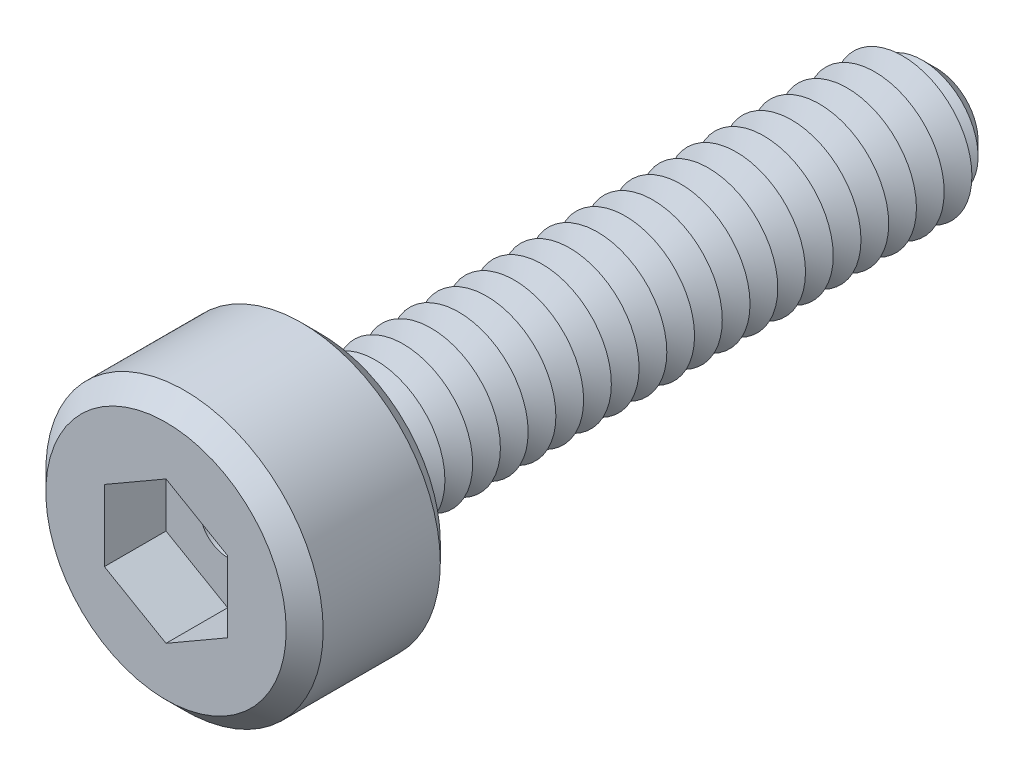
ISO-10303-21;
HEADER;
FILE_DESCRIPTION(('STEP AP214'),'2;1');
FILE_NAME('part.step','',(''),(''),'','','');
FILE_SCHEMA(('AUTOMOTIVE_DESIGN { 1 0 10303 214 1 1 1 1 }'));
ENDSEC;
DATA;
#1=APPLICATION_CONTEXT('core data for automotive mechanical design processes');
#2=APPLICATION_PROTOCOL_DEFINITION('international standard','automotive_design',2000,#1);
#3=PRODUCT_CONTEXT('',#1,'mechanical');
#4=PRODUCT('Part','Part','',(#3));
#5=PRODUCT_RELATED_PRODUCT_CATEGORY('part','',(#4));
#6=PRODUCT_DEFINITION_FORMATION('','',#4);
#7=PRODUCT_DEFINITION_CONTEXT('part definition',#1,'design');
#8=PRODUCT_DEFINITION('design','',#6,#7);
#9=PRODUCT_DEFINITION_SHAPE('','',#8);
#10=(LENGTH_UNIT() NAMED_UNIT(*) SI_UNIT(.MILLI.,.METRE.));
#11=(NAMED_UNIT(*) PLANE_ANGLE_UNIT() SI_UNIT($,.RADIAN.));
#12=(NAMED_UNIT(*) SI_UNIT($,.STERADIAN.) SOLID_ANGLE_UNIT());
#13=UNCERTAINTY_MEASURE_WITH_UNIT(LENGTH_MEASURE(1.E-05),#10,'distance_accuracy_value','');
#14=(GEOMETRIC_REPRESENTATION_CONTEXT(3) GLOBAL_UNCERTAINTY_ASSIGNED_CONTEXT((#13)) GLOBAL_UNIT_ASSIGNED_CONTEXT((#10,
#11,#12)) REPRESENTATION_CONTEXT('',''));
#15=CARTESIAN_POINT('',(0.,0.,0.));
#16=DIRECTION('',(0.,0.,1.));
#17=DIRECTION('',(1.,0.,0.));
#18=AXIS2_PLACEMENT_3D('',#15,#16,#17);
#19=CARTESIAN_POINT('',(0.,0.,2.5));
#20=DIRECTION('',(0.,0.,-1.));
#21=DIRECTION('',(-1.,0.,0.));
#22=AXIS2_PLACEMENT_3D('',#19,#20,#21);
#23=CYLINDRICAL_SURFACE('',#22,2.25);
#24=CARTESIAN_POINT('',(0.,0.,0.299999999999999));
#25=DIRECTION('',(0.,0.,1.));
#26=DIRECTION('',(1.,0.,0.));
#27=AXIS2_PLACEMENT_3D('',#24,#25,#26);
#28=CIRCLE('',#27,2.25);
#29=CARTESIAN_POINT('',(2.25,0.,0.299999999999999));
#30=VERTEX_POINT('',#29);
#31=EDGE_CURVE('E353',#30,#30,#28,.T.);
#32=ORIENTED_EDGE('',*,*,#31,.T.);
#33=EDGE_LOOP('',(#32));
#34=FACE_BOUND('',#33,.T.);
#35=CARTESIAN_POINT('',(0.,0.,2.2));
#36=DIRECTION('',(0.,0.,1.));
#37=DIRECTION('',(1.,0.,0.));
#38=AXIS2_PLACEMENT_3D('',#35,#36,#37);
#39=CIRCLE('',#38,2.25);
#40=CARTESIAN_POINT('',(2.25,0.,2.2));
#41=VERTEX_POINT('',#40);
#42=EDGE_CURVE('E346',#41,#41,#39,.F.);
#43=ORIENTED_EDGE('',*,*,#42,.T.);
#44=EDGE_LOOP('',(#43));
#45=FACE_BOUND('',#44,.T.);
#46=ADVANCED_FACE('F39',(#34,#45),#23,.T.);
#47=CARTESIAN_POINT('',(0.,0.,2.5));
#48=DIRECTION('',(0.,0.,1.));
#49=DIRECTION('',(1.,0.,0.));
#50=AXIS2_PLACEMENT_3D('',#47,#48,#49);
#51=PLANE('',#50);
#52=CARTESIAN_POINT('',(0.,0.,2.5));
#53=DIRECTION('',(0.,0.,1.));
#54=DIRECTION('',(1.,0.,0.));
#55=AXIS2_PLACEMENT_3D('',#52,#53,#54);
#56=CIRCLE('',#55,1.95);
#57=CARTESIAN_POINT('',(1.95,0.,2.5));
#58=VERTEX_POINT('',#57);
#59=EDGE_CURVE('E11',#58,#58,#56,.T.);
#60=ORIENTED_EDGE('',*,*,#59,.T.);
#61=EDGE_LOOP('',(#60));
#62=FACE_BOUND('',#61,.T.);
#63=DIRECTION('',(-0.866025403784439,0.5,0.));
#64=VECTOR('',#63,1.);
#65=CARTESIAN_POINT('',(0.999999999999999,0.577350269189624,2.5));
#66=LINE('',#65,#64);
#67=CARTESIAN_POINT('',(0.999999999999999,0.577350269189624,2.5));
#68=VERTEX_POINT('',#67);
#69=CARTESIAN_POINT('',(0.,1.15470053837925,2.5));
#70=VERTEX_POINT('',#69);
#71=EDGE_CURVE('E55',#68,#70,#66,.T.);
#72=ORIENTED_EDGE('',*,*,#71,.F.);
#73=DIRECTION('',(0.,1.,0.));
#74=VECTOR('',#73,1.);
#75=CARTESIAN_POINT('',(1.,-0.577350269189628,2.5));
#76=LINE('',#75,#74);
#77=CARTESIAN_POINT('',(1.,-0.577350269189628,2.5));
#78=VERTEX_POINT('',#77);
#79=EDGE_CURVE('E150',#78,#68,#76,.T.);
#80=ORIENTED_EDGE('',*,*,#79,.F.);
#81=DIRECTION('',(0.866025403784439,0.5,0.));
#82=VECTOR('',#81,1.);
#83=CARTESIAN_POINT('',(0.,-1.15470053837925,2.5));
#84=LINE('',#83,#82);
#85=CARTESIAN_POINT('',(0.,-1.15470053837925,2.5));
#86=VERTEX_POINT('',#85);
#87=EDGE_CURVE('E147',#86,#78,#84,.T.);
#88=ORIENTED_EDGE('',*,*,#87,.F.);
#89=DIRECTION('',(0.866025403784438,-0.5,0.));
#90=VECTOR('',#89,1.);
#91=CARTESIAN_POINT('',(-1.,-0.577350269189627,2.5));
#92=LINE('',#91,#90);
#93=CARTESIAN_POINT('',(-1.,-0.577350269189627,2.5));
#94=VERTEX_POINT('',#93);
#95=EDGE_CURVE('E103',#94,#86,#92,.T.);
#96=ORIENTED_EDGE('',*,*,#95,.F.);
#97=DIRECTION('',(0.,-1.,0.));
#98=VECTOR('',#97,1.);
#99=CARTESIAN_POINT('',(-1.,0.577350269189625,2.5));
#100=LINE('',#99,#98);
#101=CARTESIAN_POINT('',(-1.,0.577350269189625,2.5));
#102=VERTEX_POINT('',#101);
#103=EDGE_CURVE('E142',#102,#94,#100,.T.);
#104=ORIENTED_EDGE('',*,*,#103,.F.);
#105=DIRECTION('',(-0.866025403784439,-0.5,0.));
#106=VECTOR('',#105,1.);
#107=CARTESIAN_POINT('',(0.,1.15470053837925,2.5));
#108=LINE('',#107,#106);
#109=EDGE_CURVE('E137',#70,#102,#108,.T.);
#110=ORIENTED_EDGE('',*,*,#109,.F.);
#111=EDGE_LOOP('',(#72,#80,#88,#96,#104,#110));
#112=FACE_BOUND('',#111,.T.);
#113=ADVANCED_FACE('F371',(#62,#112),#51,.T.);
#114=CARTESIAN_POINT('',(0.,0.,0.));
#115=DIRECTION('',(0.,0.,1.));
#116=DIRECTION('',(1.,0.,0.));
#117=AXIS2_PLACEMENT_3D('',#114,#115,#116);
#118=PLANE('',#117);
#119=CARTESIAN_POINT('',(0.,0.,0.));
#120=DIRECTION('',(0.,0.,1.));
#121=DIRECTION('',(1.,0.,0.));
#122=AXIS2_PLACEMENT_3D('',#119,#120,#121);
#123=CIRCLE('',#122,1.95);
#124=CARTESIAN_POINT('',(1.95,0.,0.));
#125=VERTEX_POINT('',#124);
#126=EDGE_CURVE('E48',#125,#125,#123,.F.);
#127=ORIENTED_EDGE('',*,*,#126,.T.);
#128=EDGE_LOOP('',(#127));
#129=FACE_BOUND('',#128,.T.);
#130=CARTESIAN_POINT('',(0.,0.,0.));
#131=DIRECTION('',(0.,0.,1.));
#132=DIRECTION('',(1.,0.,0.));
#133=AXIS2_PLACEMENT_3D('',#130,#131,#132);
#134=CIRCLE('',#133,1.125);
#135=CARTESIAN_POINT('',(1.125,0.,0.));
#136=VERTEX_POINT('',#135);
#137=EDGE_CURVE('E338',#136,#136,#134,.T.);
#138=ORIENTED_EDGE('',*,*,#137,.T.);
#139=EDGE_LOOP('',(#138));
#140=FACE_BOUND('',#139,.T.);
#141=ADVANCED_FACE('F360',(#129,#140),#118,.F.);
#142=CARTESIAN_POINT('',(0.,0.,0.));
#143=DIRECTION('',(0.,0.,1.));
#144=DIRECTION('',(1.,0.,0.));
#145=AXIS2_PLACEMENT_3D('',#142,#143,#144);
#146=CONICAL_SURFACE('',#145,1.125,1.0471975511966);
#147=CARTESIAN_POINT('',(0.,0.,-0.225));
#148=DIRECTION('',(0.,0.,1.));
#149=DIRECTION('',(1.,0.,0.));
#150=AXIS2_PLACEMENT_3D('',#147,#148,#149);
#151=CIRCLE('',#150,0.735288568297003);
#152=CARTESIAN_POINT('',(0.735288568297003,0.,-0.225));
#153=VERTEX_POINT('',#152);
#154=EDGE_CURVE('E334',#153,#153,#151,.T.);
#155=ORIENTED_EDGE('',*,*,#154,.T.);
#156=EDGE_LOOP('',(#155));
#157=FACE_BOUND('',#156,.T.);
#158=ORIENTED_EDGE('',*,*,#137,.F.);
#159=EDGE_LOOP('',(#158));
#160=FACE_BOUND('',#159,.T.);
#161=ADVANCED_FACE('F596',(#157,#160),#146,.T.);
#162=CARTESIAN_POINT('',(0.,0.,-0.225));
#163=DIRECTION('',(0.,0.,-1.));
#164=DIRECTION('',(-1.,0.,0.));
#165=AXIS2_PLACEMENT_3D('',#162,#163,#164);
#166=CONICAL_SURFACE('',#165,0.735288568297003,1.0471975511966);
#167=CARTESIAN_POINT('',(0.,0.,-0.45));
#168=DIRECTION('',(0.,0.,1.));
#169=DIRECTION('',(1.,0.,0.));
#170=AXIS2_PLACEMENT_3D('',#167,#168,#169);
#171=CIRCLE('',#170,1.125);
#172=CARTESIAN_POINT('',(1.125,0.,-0.45));
#173=VERTEX_POINT('',#172);
#174=EDGE_CURVE('E330',#173,#173,#171,.T.);
#175=ORIENTED_EDGE('',*,*,#174,.T.);
#176=EDGE_LOOP('',(#175));
#177=FACE_BOUND('',#176,.T.);
#178=ORIENTED_EDGE('',*,*,#154,.F.);
#179=EDGE_LOOP('',(#178));
#180=FACE_BOUND('',#179,.T.);
#181=ADVANCED_FACE('F592',(#177,#180),#166,.T.);
#182=CARTESIAN_POINT('',(0.,0.,-0.45));
#183=DIRECTION('',(0.,0.,1.));
#184=DIRECTION('',(1.,0.,0.));
#185=AXIS2_PLACEMENT_3D('',#182,#183,#184);
#186=CONICAL_SURFACE('',#185,1.125,1.0471975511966);
#187=CARTESIAN_POINT('',(0.,0.,-0.675));
#188=DIRECTION('',(0.,0.,1.));
#189=DIRECTION('',(1.,0.,0.));
#190=AXIS2_PLACEMENT_3D('',#187,#188,#189);
#191=CIRCLE('',#190,0.735288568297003);
#192=CARTESIAN_POINT('',(0.735288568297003,0.,-0.675));
#193=VERTEX_POINT('',#192);
#194=EDGE_CURVE('E326',#193,#193,#191,.T.);
#195=ORIENTED_EDGE('',*,*,#194,.T.);
#196=EDGE_LOOP('',(#195));
#197=FACE_BOUND('',#196,.T.);
#198=ORIENTED_EDGE('',*,*,#174,.F.);
#199=EDGE_LOOP('',(#198));
#200=FACE_BOUND('',#199,.T.);
#201=ADVANCED_FACE('F588',(#197,#200),#186,.T.);
#202=CARTESIAN_POINT('',(0.,0.,-0.675));
#203=DIRECTION('',(0.,0.,-1.));
#204=DIRECTION('',(-1.,0.,0.));
#205=AXIS2_PLACEMENT_3D('',#202,#203,#204);
#206=CONICAL_SURFACE('',#205,0.735288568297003,1.0471975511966);
#207=CARTESIAN_POINT('',(0.,0.,-0.9));
#208=DIRECTION('',(0.,0.,1.));
#209=DIRECTION('',(1.,0.,0.));
#210=AXIS2_PLACEMENT_3D('',#207,#208,#209);
#211=CIRCLE('',#210,1.125);
#212=CARTESIAN_POINT('',(1.125,0.,-0.9));
#213=VERTEX_POINT('',#212);
#214=EDGE_CURVE('E322',#213,#213,#211,.T.);
#215=ORIENTED_EDGE('',*,*,#214,.T.);
#216=EDGE_LOOP('',(#215));
#217=FACE_BOUND('',#216,.T.);
#218=ORIENTED_EDGE('',*,*,#194,.F.);
#219=EDGE_LOOP('',(#218));
#220=FACE_BOUND('',#219,.T.);
#221=ADVANCED_FACE('F584',(#217,#220),#206,.T.);
#222=CARTESIAN_POINT('',(0.,0.,-0.9));
#223=DIRECTION('',(0.,0.,1.));
#224=DIRECTION('',(1.,0.,0.));
#225=AXIS2_PLACEMENT_3D('',#222,#223,#224);
#226=CONICAL_SURFACE('',#225,1.125,1.0471975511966);
#227=CARTESIAN_POINT('',(0.,0.,-1.125));
#228=DIRECTION('',(0.,0.,1.));
#229=DIRECTION('',(1.,0.,0.));
#230=AXIS2_PLACEMENT_3D('',#227,#228,#229);
#231=CIRCLE('',#230,0.735288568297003);
#232=CARTESIAN_POINT('',(0.735288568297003,0.,-1.125));
#233=VERTEX_POINT('',#232);
#234=EDGE_CURVE('E318',#233,#233,#231,.T.);
#235=ORIENTED_EDGE('',*,*,#234,.T.);
#236=EDGE_LOOP('',(#235));
#237=FACE_BOUND('',#236,.T.);
#238=ORIENTED_EDGE('',*,*,#214,.F.);
#239=EDGE_LOOP('',(#238));
#240=FACE_BOUND('',#239,.T.);
#241=ADVANCED_FACE('F580',(#237,#240),#226,.T.);
#242=CARTESIAN_POINT('',(0.,0.,-1.125));
#243=DIRECTION('',(0.,0.,-1.));
#244=DIRECTION('',(-1.,0.,0.));
#245=AXIS2_PLACEMENT_3D('',#242,#243,#244);
#246=CONICAL_SURFACE('',#245,0.735288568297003,1.0471975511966);
#247=CARTESIAN_POINT('',(0.,0.,-1.35));
#248=DIRECTION('',(0.,0.,1.));
#249=DIRECTION('',(1.,0.,0.));
#250=AXIS2_PLACEMENT_3D('',#247,#248,#249);
#251=CIRCLE('',#250,1.125);
#252=CARTESIAN_POINT('',(1.125,0.,-1.35));
#253=VERTEX_POINT('',#252);
#254=EDGE_CURVE('E314',#253,#253,#251,.T.);
#255=ORIENTED_EDGE('',*,*,#254,.T.);
#256=EDGE_LOOP('',(#255));
#257=FACE_BOUND('',#256,.T.);
#258=ORIENTED_EDGE('',*,*,#234,.F.);
#259=EDGE_LOOP('',(#258));
#260=FACE_BOUND('',#259,.T.);
#261=ADVANCED_FACE('F576',(#257,#260),#246,.T.);
#262=CARTESIAN_POINT('',(0.,0.,-1.35));
#263=DIRECTION('',(0.,0.,1.));
#264=DIRECTION('',(1.,0.,0.));
#265=AXIS2_PLACEMENT_3D('',#262,#263,#264);
#266=CONICAL_SURFACE('',#265,1.125,1.0471975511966);
#267=CARTESIAN_POINT('',(0.,0.,-1.575));
#268=DIRECTION('',(0.,0.,1.));
#269=DIRECTION('',(1.,0.,0.));
#270=AXIS2_PLACEMENT_3D('',#267,#268,#269);
#271=CIRCLE('',#270,0.735288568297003);
#272=CARTESIAN_POINT('',(0.735288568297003,0.,-1.575));
#273=VERTEX_POINT('',#272);
#274=EDGE_CURVE('E310',#273,#273,#271,.T.);
#275=ORIENTED_EDGE('',*,*,#274,.T.);
#276=EDGE_LOOP('',(#275));
#277=FACE_BOUND('',#276,.T.);
#278=ORIENTED_EDGE('',*,*,#254,.F.);
#279=EDGE_LOOP('',(#278));
#280=FACE_BOUND('',#279,.T.);
#281=ADVANCED_FACE('F572',(#277,#280),#266,.T.);
#282=CARTESIAN_POINT('',(0.,0.,-1.575));
#283=DIRECTION('',(0.,0.,-1.));
#284=DIRECTION('',(-1.,0.,0.));
#285=AXIS2_PLACEMENT_3D('',#282,#283,#284);
#286=CONICAL_SURFACE('',#285,0.735288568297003,1.0471975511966);
#287=CARTESIAN_POINT('',(0.,0.,-1.8));
#288=DIRECTION('',(0.,0.,1.));
#289=DIRECTION('',(1.,0.,0.));
#290=AXIS2_PLACEMENT_3D('',#287,#288,#289);
#291=CIRCLE('',#290,1.125);
#292=CARTESIAN_POINT('',(1.125,0.,-1.8));
#293=VERTEX_POINT('',#292);
#294=EDGE_CURVE('E306',#293,#293,#291,.T.);
#295=ORIENTED_EDGE('',*,*,#294,.T.);
#296=EDGE_LOOP('',(#295));
#297=FACE_BOUND('',#296,.T.);
#298=ORIENTED_EDGE('',*,*,#274,.F.);
#299=EDGE_LOOP('',(#298));
#300=FACE_BOUND('',#299,.T.);
#301=ADVANCED_FACE('F568',(#297,#300),#286,.T.);
#302=CARTESIAN_POINT('',(0.,0.,-1.8));
#303=DIRECTION('',(0.,0.,1.));
#304=DIRECTION('',(1.,0.,0.));
#305=AXIS2_PLACEMENT_3D('',#302,#303,#304);
#306=CONICAL_SURFACE('',#305,1.125,1.0471975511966);
#307=CARTESIAN_POINT('',(0.,0.,-2.025));
#308=DIRECTION('',(0.,0.,1.));
#309=DIRECTION('',(1.,0.,0.));
#310=AXIS2_PLACEMENT_3D('',#307,#308,#309);
#311=CIRCLE('',#310,0.735288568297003);
#312=CARTESIAN_POINT('',(0.735288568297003,0.,-2.025));
#313=VERTEX_POINT('',#312);
#314=EDGE_CURVE('E302',#313,#313,#311,.T.);
#315=ORIENTED_EDGE('',*,*,#314,.T.);
#316=EDGE_LOOP('',(#315));
#317=FACE_BOUND('',#316,.T.);
#318=ORIENTED_EDGE('',*,*,#294,.F.);
#319=EDGE_LOOP('',(#318));
#320=FACE_BOUND('',#319,.T.);
#321=ADVANCED_FACE('F564',(#317,#320),#306,.T.);
#322=CARTESIAN_POINT('',(0.,0.,-2.025));
#323=DIRECTION('',(0.,0.,-1.));
#324=DIRECTION('',(-1.,0.,0.));
#325=AXIS2_PLACEMENT_3D('',#322,#323,#324);
#326=CONICAL_SURFACE('',#325,0.735288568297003,1.0471975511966);
#327=CARTESIAN_POINT('',(0.,0.,-2.25));
#328=DIRECTION('',(0.,0.,1.));
#329=DIRECTION('',(1.,0.,0.));
#330=AXIS2_PLACEMENT_3D('',#327,#328,#329);
#331=CIRCLE('',#330,1.125);
#332=CARTESIAN_POINT('',(1.125,0.,-2.25));
#333=VERTEX_POINT('',#332);
#334=EDGE_CURVE('E298',#333,#333,#331,.T.);
#335=ORIENTED_EDGE('',*,*,#334,.T.);
#336=EDGE_LOOP('',(#335));
#337=FACE_BOUND('',#336,.T.);
#338=ORIENTED_EDGE('',*,*,#314,.F.);
#339=EDGE_LOOP('',(#338));
#340=FACE_BOUND('',#339,.T.);
#341=ADVANCED_FACE('F560',(#337,#340),#326,.T.);
#342=CARTESIAN_POINT('',(0.,0.,-2.25));
#343=DIRECTION('',(0.,0.,1.));
#344=DIRECTION('',(1.,0.,0.));
#345=AXIS2_PLACEMENT_3D('',#342,#343,#344);
#346=CONICAL_SURFACE('',#345,1.125,1.0471975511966);
#347=CARTESIAN_POINT('',(0.,0.,-2.475));
#348=DIRECTION('',(0.,0.,1.));
#349=DIRECTION('',(1.,0.,0.));
#350=AXIS2_PLACEMENT_3D('',#347,#348,#349);
#351=CIRCLE('',#350,0.735288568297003);
#352=CARTESIAN_POINT('',(0.735288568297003,0.,-2.475));
#353=VERTEX_POINT('',#352);
#354=EDGE_CURVE('E294',#353,#353,#351,.T.);
#355=ORIENTED_EDGE('',*,*,#354,.T.);
#356=EDGE_LOOP('',(#355));
#357=FACE_BOUND('',#356,.T.);
#358=ORIENTED_EDGE('',*,*,#334,.F.);
#359=EDGE_LOOP('',(#358));
#360=FACE_BOUND('',#359,.T.);
#361=ADVANCED_FACE('F556',(#357,#360),#346,.T.);
#362=CARTESIAN_POINT('',(0.,0.,-2.475));
#363=DIRECTION('',(0.,0.,-1.));
#364=DIRECTION('',(-1.,0.,0.));
#365=AXIS2_PLACEMENT_3D('',#362,#363,#364);
#366=CONICAL_SURFACE('',#365,0.735288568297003,1.0471975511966);
#367=CARTESIAN_POINT('',(0.,0.,-2.7));
#368=DIRECTION('',(0.,0.,1.));
#369=DIRECTION('',(1.,0.,0.));
#370=AXIS2_PLACEMENT_3D('',#367,#368,#369);
#371=CIRCLE('',#370,1.125);
#372=CARTESIAN_POINT('',(1.125,0.,-2.7));
#373=VERTEX_POINT('',#372);
#374=EDGE_CURVE('E290',#373,#373,#371,.T.);
#375=ORIENTED_EDGE('',*,*,#374,.T.);
#376=EDGE_LOOP('',(#375));
#377=FACE_BOUND('',#376,.T.);
#378=ORIENTED_EDGE('',*,*,#354,.F.);
#379=EDGE_LOOP('',(#378));
#380=FACE_BOUND('',#379,.T.);
#381=ADVANCED_FACE('F552',(#377,#380),#366,.T.);
#382=CARTESIAN_POINT('',(0.,0.,-2.7));
#383=DIRECTION('',(0.,0.,1.));
#384=DIRECTION('',(1.,0.,0.));
#385=AXIS2_PLACEMENT_3D('',#382,#383,#384);
#386=CONICAL_SURFACE('',#385,1.125,1.0471975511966);
#387=CARTESIAN_POINT('',(0.,0.,-2.925));
#388=DIRECTION('',(0.,0.,1.));
#389=DIRECTION('',(1.,0.,0.));
#390=AXIS2_PLACEMENT_3D('',#387,#388,#389);
#391=CIRCLE('',#390,0.735288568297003);
#392=CARTESIAN_POINT('',(0.735288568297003,0.,-2.925));
#393=VERTEX_POINT('',#392);
#394=EDGE_CURVE('E286',#393,#393,#391,.T.);
#395=ORIENTED_EDGE('',*,*,#394,.T.);
#396=EDGE_LOOP('',(#395));
#397=FACE_BOUND('',#396,.T.);
#398=ORIENTED_EDGE('',*,*,#374,.F.);
#399=EDGE_LOOP('',(#398));
#400=FACE_BOUND('',#399,.T.);
#401=ADVANCED_FACE('F548',(#397,#400),#386,.T.);
#402=CARTESIAN_POINT('',(0.,0.,-2.925));
#403=DIRECTION('',(0.,0.,-1.));
#404=DIRECTION('',(-1.,0.,0.));
#405=AXIS2_PLACEMENT_3D('',#402,#403,#404);
#406=CONICAL_SURFACE('',#405,0.735288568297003,1.0471975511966);
#407=CARTESIAN_POINT('',(0.,0.,-3.15));
#408=DIRECTION('',(0.,0.,1.));
#409=DIRECTION('',(1.,0.,0.));
#410=AXIS2_PLACEMENT_3D('',#407,#408,#409);
#411=CIRCLE('',#410,1.125);
#412=CARTESIAN_POINT('',(1.125,0.,-3.15));
#413=VERTEX_POINT('',#412);
#414=EDGE_CURVE('E282',#413,#413,#411,.T.);
#415=ORIENTED_EDGE('',*,*,#414,.T.);
#416=EDGE_LOOP('',(#415));
#417=FACE_BOUND('',#416,.T.);
#418=ORIENTED_EDGE('',*,*,#394,.F.);
#419=EDGE_LOOP('',(#418));
#420=FACE_BOUND('',#419,.T.);
#421=ADVANCED_FACE('F544',(#417,#420),#406,.T.);
#422=CARTESIAN_POINT('',(0.,0.,-3.15));
#423=DIRECTION('',(0.,0.,1.));
#424=DIRECTION('',(1.,0.,0.));
#425=AXIS2_PLACEMENT_3D('',#422,#423,#424);
#426=CONICAL_SURFACE('',#425,1.125,1.0471975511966);
#427=CARTESIAN_POINT('',(0.,0.,-3.375));
#428=DIRECTION('',(0.,0.,1.));
#429=DIRECTION('',(1.,0.,0.));
#430=AXIS2_PLACEMENT_3D('',#427,#428,#429);
#431=CIRCLE('',#430,0.735288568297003);
#432=CARTESIAN_POINT('',(0.735288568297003,0.,-3.375));
#433=VERTEX_POINT('',#432);
#434=EDGE_CURVE('E278',#433,#433,#431,.T.);
#435=ORIENTED_EDGE('',*,*,#434,.T.);
#436=EDGE_LOOP('',(#435));
#437=FACE_BOUND('',#436,.T.);
#438=ORIENTED_EDGE('',*,*,#414,.F.);
#439=EDGE_LOOP('',(#438));
#440=FACE_BOUND('',#439,.T.);
#441=ADVANCED_FACE('F540',(#437,#440),#426,.T.);
#442=CARTESIAN_POINT('',(0.,0.,-3.375));
#443=DIRECTION('',(0.,0.,-1.));
#444=DIRECTION('',(-1.,0.,0.));
#445=AXIS2_PLACEMENT_3D('',#442,#443,#444);
#446=CONICAL_SURFACE('',#445,0.735288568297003,1.0471975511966);
#447=CARTESIAN_POINT('',(0.,0.,-3.6));
#448=DIRECTION('',(0.,0.,1.));
#449=DIRECTION('',(1.,0.,0.));
#450=AXIS2_PLACEMENT_3D('',#447,#448,#449);
#451=CIRCLE('',#450,1.125);
#452=CARTESIAN_POINT('',(1.125,0.,-3.6));
#453=VERTEX_POINT('',#452);
#454=EDGE_CURVE('E274',#453,#453,#451,.T.);
#455=ORIENTED_EDGE('',*,*,#454,.T.);
#456=EDGE_LOOP('',(#455));
#457=FACE_BOUND('',#456,.T.);
#458=ORIENTED_EDGE('',*,*,#434,.F.);
#459=EDGE_LOOP('',(#458));
#460=FACE_BOUND('',#459,.T.);
#461=ADVANCED_FACE('F536',(#457,#460),#446,.T.);
#462=CARTESIAN_POINT('',(0.,0.,-3.6));
#463=DIRECTION('',(0.,0.,1.));
#464=DIRECTION('',(1.,0.,0.));
#465=AXIS2_PLACEMENT_3D('',#462,#463,#464);
#466=CONICAL_SURFACE('',#465,1.125,1.0471975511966);
#467=CARTESIAN_POINT('',(0.,0.,-3.825));
#468=DIRECTION('',(0.,0.,1.));
#469=DIRECTION('',(1.,0.,0.));
#470=AXIS2_PLACEMENT_3D('',#467,#468,#469);
#471=CIRCLE('',#470,0.735288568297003);
#472=CARTESIAN_POINT('',(0.735288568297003,0.,-3.825));
#473=VERTEX_POINT('',#472);
#474=EDGE_CURVE('E270',#473,#473,#471,.T.);
#475=ORIENTED_EDGE('',*,*,#474,.T.);
#476=EDGE_LOOP('',(#475));
#477=FACE_BOUND('',#476,.T.);
#478=ORIENTED_EDGE('',*,*,#454,.F.);
#479=EDGE_LOOP('',(#478));
#480=FACE_BOUND('',#479,.T.);
#481=ADVANCED_FACE('F532',(#477,#480),#466,.T.);
#482=CARTESIAN_POINT('',(0.,0.,-3.825));
#483=DIRECTION('',(0.,0.,-1.));
#484=DIRECTION('',(-1.,0.,0.));
#485=AXIS2_PLACEMENT_3D('',#482,#483,#484);
#486=CONICAL_SURFACE('',#485,0.735288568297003,1.0471975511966);
#487=CARTESIAN_POINT('',(0.,0.,-4.05));
#488=DIRECTION('',(0.,0.,1.));
#489=DIRECTION('',(1.,0.,0.));
#490=AXIS2_PLACEMENT_3D('',#487,#488,#489);
#491=CIRCLE('',#490,1.125);
#492=CARTESIAN_POINT('',(1.125,0.,-4.05));
#493=VERTEX_POINT('',#492);
#494=EDGE_CURVE('E266',#493,#493,#491,.T.);
#495=ORIENTED_EDGE('',*,*,#494,.T.);
#496=EDGE_LOOP('',(#495));
#497=FACE_BOUND('',#496,.T.);
#498=ORIENTED_EDGE('',*,*,#474,.F.);
#499=EDGE_LOOP('',(#498));
#500=FACE_BOUND('',#499,.T.);
#501=ADVANCED_FACE('F528',(#497,#500),#486,.T.);
#502=CARTESIAN_POINT('',(0.,0.,-4.05));
#503=DIRECTION('',(0.,0.,1.));
#504=DIRECTION('',(1.,0.,0.));
#505=AXIS2_PLACEMENT_3D('',#502,#503,#504);
#506=CONICAL_SURFACE('',#505,1.125,1.0471975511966);
#507=CARTESIAN_POINT('',(0.,0.,-4.275));
#508=DIRECTION('',(0.,0.,1.));
#509=DIRECTION('',(1.,0.,0.));
#510=AXIS2_PLACEMENT_3D('',#507,#508,#509);
#511=CIRCLE('',#510,0.735288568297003);
#512=CARTESIAN_POINT('',(0.735288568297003,0.,-4.275));
#513=VERTEX_POINT('',#512);
#514=EDGE_CURVE('E262',#513,#513,#511,.T.);
#515=ORIENTED_EDGE('',*,*,#514,.T.);
#516=EDGE_LOOP('',(#515));
#517=FACE_BOUND('',#516,.T.);
#518=ORIENTED_EDGE('',*,*,#494,.F.);
#519=EDGE_LOOP('',(#518));
#520=FACE_BOUND('',#519,.T.);
#521=ADVANCED_FACE('F524',(#517,#520),#506,.T.);
#522=CARTESIAN_POINT('',(0.,0.,-4.275));
#523=DIRECTION('',(0.,0.,-1.));
#524=DIRECTION('',(-1.,0.,0.));
#525=AXIS2_PLACEMENT_3D('',#522,#523,#524);
#526=CONICAL_SURFACE('',#525,0.735288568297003,1.0471975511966);
#527=CARTESIAN_POINT('',(0.,0.,-4.5));
#528=DIRECTION('',(0.,0.,1.));
#529=DIRECTION('',(1.,0.,0.));
#530=AXIS2_PLACEMENT_3D('',#527,#528,#529);
#531=CIRCLE('',#530,1.125);
#532=CARTESIAN_POINT('',(1.125,0.,-4.5));
#533=VERTEX_POINT('',#532);
#534=EDGE_CURVE('E258',#533,#533,#531,.T.);
#535=ORIENTED_EDGE('',*,*,#534,.T.);
#536=EDGE_LOOP('',(#535));
#537=FACE_BOUND('',#536,.T.);
#538=ORIENTED_EDGE('',*,*,#514,.F.);
#539=EDGE_LOOP('',(#538));
#540=FACE_BOUND('',#539,.T.);
#541=ADVANCED_FACE('F520',(#537,#540),#526,.T.);
#542=CARTESIAN_POINT('',(0.,0.,-4.5));
#543=DIRECTION('',(0.,0.,1.));
#544=DIRECTION('',(1.,0.,0.));
#545=AXIS2_PLACEMENT_3D('',#542,#543,#544);
#546=CONICAL_SURFACE('',#545,1.125,1.0471975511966);
#547=CARTESIAN_POINT('',(0.,0.,-4.725));
#548=DIRECTION('',(0.,0.,1.));
#549=DIRECTION('',(1.,0.,0.));
#550=AXIS2_PLACEMENT_3D('',#547,#548,#549);
#551=CIRCLE('',#550,0.735288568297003);
#552=CARTESIAN_POINT('',(0.735288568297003,0.,-4.725));
#553=VERTEX_POINT('',#552);
#554=EDGE_CURVE('E254',#553,#553,#551,.T.);
#555=ORIENTED_EDGE('',*,*,#554,.T.);
#556=EDGE_LOOP('',(#555));
#557=FACE_BOUND('',#556,.T.);
#558=ORIENTED_EDGE('',*,*,#534,.F.);
#559=EDGE_LOOP('',(#558));
#560=FACE_BOUND('',#559,.T.);
#561=ADVANCED_FACE('F516',(#557,#560),#546,.T.);
#562=CARTESIAN_POINT('',(0.,0.,-4.725));
#563=DIRECTION('',(0.,0.,-1.));
#564=DIRECTION('',(-1.,0.,0.));
#565=AXIS2_PLACEMENT_3D('',#562,#563,#564);
#566=CONICAL_SURFACE('',#565,0.735288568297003,1.0471975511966);
#567=CARTESIAN_POINT('',(0.,0.,-4.95));
#568=DIRECTION('',(0.,0.,1.));
#569=DIRECTION('',(1.,0.,0.));
#570=AXIS2_PLACEMENT_3D('',#567,#568,#569);
#571=CIRCLE('',#570,1.125);
#572=CARTESIAN_POINT('',(1.125,0.,-4.95));
#573=VERTEX_POINT('',#572);
#574=EDGE_CURVE('E250',#573,#573,#571,.T.);
#575=ORIENTED_EDGE('',*,*,#574,.T.);
#576=EDGE_LOOP('',(#575));
#577=FACE_BOUND('',#576,.T.);
#578=ORIENTED_EDGE('',*,*,#554,.F.);
#579=EDGE_LOOP('',(#578));
#580=FACE_BOUND('',#579,.T.);
#581=ADVANCED_FACE('F512',(#577,#580),#566,.T.);
#582=CARTESIAN_POINT('',(0.,0.,-4.95));
#583=DIRECTION('',(0.,0.,1.));
#584=DIRECTION('',(1.,0.,0.));
#585=AXIS2_PLACEMENT_3D('',#582,#583,#584);
#586=CONICAL_SURFACE('',#585,1.125,1.0471975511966);
#587=CARTESIAN_POINT('',(0.,0.,-5.175));
#588=DIRECTION('',(0.,0.,1.));
#589=DIRECTION('',(1.,0.,0.));
#590=AXIS2_PLACEMENT_3D('',#587,#588,#589);
#591=CIRCLE('',#590,0.735288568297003);
#592=CARTESIAN_POINT('',(0.735288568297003,0.,-5.175));
#593=VERTEX_POINT('',#592);
#594=EDGE_CURVE('E246',#593,#593,#591,.T.);
#595=ORIENTED_EDGE('',*,*,#594,.T.);
#596=EDGE_LOOP('',(#595));
#597=FACE_BOUND('',#596,.T.);
#598=ORIENTED_EDGE('',*,*,#574,.F.);
#599=EDGE_LOOP('',(#598));
#600=FACE_BOUND('',#599,.T.);
#601=ADVANCED_FACE('F508',(#597,#600),#586,.T.);
#602=CARTESIAN_POINT('',(0.,0.,-5.175));
#603=DIRECTION('',(0.,0.,-1.));
#604=DIRECTION('',(-1.,0.,0.));
#605=AXIS2_PLACEMENT_3D('',#602,#603,#604);
#606=CONICAL_SURFACE('',#605,0.735288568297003,1.0471975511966);
#607=CARTESIAN_POINT('',(0.,0.,-5.4));
#608=DIRECTION('',(0.,0.,1.));
#609=DIRECTION('',(1.,0.,0.));
#610=AXIS2_PLACEMENT_3D('',#607,#608,#609);
#611=CIRCLE('',#610,1.125);
#612=CARTESIAN_POINT('',(1.125,0.,-5.4));
#613=VERTEX_POINT('',#612);
#614=EDGE_CURVE('E242',#613,#613,#611,.T.);
#615=ORIENTED_EDGE('',*,*,#614,.T.);
#616=EDGE_LOOP('',(#615));
#617=FACE_BOUND('',#616,.T.);
#618=ORIENTED_EDGE('',*,*,#594,.F.);
#619=EDGE_LOOP('',(#618));
#620=FACE_BOUND('',#619,.T.);
#621=ADVANCED_FACE('F504',(#617,#620),#606,.T.);
#622=CARTESIAN_POINT('',(0.,0.,-5.4));
#623=DIRECTION('',(0.,0.,1.));
#624=DIRECTION('',(1.,0.,0.));
#625=AXIS2_PLACEMENT_3D('',#622,#623,#624);
#626=CONICAL_SURFACE('',#625,1.125,1.0471975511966);
#627=CARTESIAN_POINT('',(0.,0.,-5.625));
#628=DIRECTION('',(0.,0.,1.));
#629=DIRECTION('',(1.,0.,0.));
#630=AXIS2_PLACEMENT_3D('',#627,#628,#629);
#631=CIRCLE('',#630,0.735288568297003);
#632=CARTESIAN_POINT('',(0.735288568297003,0.,-5.625));
#633=VERTEX_POINT('',#632);
#634=EDGE_CURVE('E238',#633,#633,#631,.T.);
#635=ORIENTED_EDGE('',*,*,#634,.T.);
#636=EDGE_LOOP('',(#635));
#637=FACE_BOUND('',#636,.T.);
#638=ORIENTED_EDGE('',*,*,#614,.F.);
#639=EDGE_LOOP('',(#638));
#640=FACE_BOUND('',#639,.T.);
#641=ADVANCED_FACE('F500',(#637,#640),#626,.T.);
#642=CARTESIAN_POINT('',(0.,0.,-5.625));
#643=DIRECTION('',(0.,0.,-1.));
#644=DIRECTION('',(-1.,0.,0.));
#645=AXIS2_PLACEMENT_3D('',#642,#643,#644);
#646=CONICAL_SURFACE('',#645,0.735288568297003,1.0471975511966);
#647=CARTESIAN_POINT('',(0.,0.,-5.85));
#648=DIRECTION('',(0.,0.,1.));
#649=DIRECTION('',(1.,0.,0.));
#650=AXIS2_PLACEMENT_3D('',#647,#648,#649);
#651=CIRCLE('',#650,1.125);
#652=CARTESIAN_POINT('',(1.125,0.,-5.85));
#653=VERTEX_POINT('',#652);
#654=EDGE_CURVE('E234',#653,#653,#651,.T.);
#655=ORIENTED_EDGE('',*,*,#654,.T.);
#656=EDGE_LOOP('',(#655));
#657=FACE_BOUND('',#656,.T.);
#658=ORIENTED_EDGE('',*,*,#634,.F.);
#659=EDGE_LOOP('',(#658));
#660=FACE_BOUND('',#659,.T.);
#661=ADVANCED_FACE('F496',(#657,#660),#646,.T.);
#662=CARTESIAN_POINT('',(0.,0.,-5.85));
#663=DIRECTION('',(0.,0.,1.));
#664=DIRECTION('',(1.,0.,0.));
#665=AXIS2_PLACEMENT_3D('',#662,#663,#664);
#666=CONICAL_SURFACE('',#665,1.125,1.0471975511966);
#667=CARTESIAN_POINT('',(0.,0.,-6.075));
#668=DIRECTION('',(0.,0.,1.));
#669=DIRECTION('',(1.,0.,0.));
#670=AXIS2_PLACEMENT_3D('',#667,#668,#669);
#671=CIRCLE('',#670,0.735288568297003);
#672=CARTESIAN_POINT('',(0.735288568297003,0.,-6.075));
#673=VERTEX_POINT('',#672);
#674=EDGE_CURVE('E230',#673,#673,#671,.T.);
#675=ORIENTED_EDGE('',*,*,#674,.T.);
#676=EDGE_LOOP('',(#675));
#677=FACE_BOUND('',#676,.T.);
#678=ORIENTED_EDGE('',*,*,#654,.F.);
#679=EDGE_LOOP('',(#678));
#680=FACE_BOUND('',#679,.T.);
#681=ADVANCED_FACE('F492',(#677,#680),#666,.T.);
#682=CARTESIAN_POINT('',(0.,0.,-6.075));
#683=DIRECTION('',(0.,0.,-1.));
#684=DIRECTION('',(-1.,0.,0.));
#685=AXIS2_PLACEMENT_3D('',#682,#683,#684);
#686=CONICAL_SURFACE('',#685,0.735288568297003,1.0471975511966);
#687=CARTESIAN_POINT('',(0.,0.,-6.3));
#688=DIRECTION('',(0.,0.,1.));
#689=DIRECTION('',(1.,0.,0.));
#690=AXIS2_PLACEMENT_3D('',#687,#688,#689);
#691=CIRCLE('',#690,1.125);
#692=CARTESIAN_POINT('',(1.125,0.,-6.3));
#693=VERTEX_POINT('',#692);
#694=EDGE_CURVE('E226',#693,#693,#691,.T.);
#695=ORIENTED_EDGE('',*,*,#694,.T.);
#696=EDGE_LOOP('',(#695));
#697=FACE_BOUND('',#696,.T.);
#698=ORIENTED_EDGE('',*,*,#674,.F.);
#699=EDGE_LOOP('',(#698));
#700=FACE_BOUND('',#699,.T.);
#701=ADVANCED_FACE('F488',(#697,#700),#686,.T.);
#702=CARTESIAN_POINT('',(0.,0.,-6.3));
#703=DIRECTION('',(0.,0.,1.));
#704=DIRECTION('',(1.,0.,0.));
#705=AXIS2_PLACEMENT_3D('',#702,#703,#704);
#706=CONICAL_SURFACE('',#705,1.125,1.0471975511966);
#707=CARTESIAN_POINT('',(0.,0.,-6.525));
#708=DIRECTION('',(0.,0.,1.));
#709=DIRECTION('',(1.,0.,0.));
#710=AXIS2_PLACEMENT_3D('',#707,#708,#709);
#711=CIRCLE('',#710,0.735288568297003);
#712=CARTESIAN_POINT('',(0.735288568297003,0.,-6.525));
#713=VERTEX_POINT('',#712);
#714=EDGE_CURVE('E222',#713,#713,#711,.T.);
#715=ORIENTED_EDGE('',*,*,#714,.T.);
#716=EDGE_LOOP('',(#715));
#717=FACE_BOUND('',#716,.T.);
#718=ORIENTED_EDGE('',*,*,#694,.F.);
#719=EDGE_LOOP('',(#718));
#720=FACE_BOUND('',#719,.T.);
#721=ADVANCED_FACE('F484',(#717,#720),#706,.T.);
#722=CARTESIAN_POINT('',(0.,0.,-6.525));
#723=DIRECTION('',(0.,0.,-1.));
#724=DIRECTION('',(-1.,0.,0.));
#725=AXIS2_PLACEMENT_3D('',#722,#723,#724);
#726=CONICAL_SURFACE('',#725,0.735288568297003,1.0471975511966);
#727=CARTESIAN_POINT('',(0.,0.,-6.75));
#728=DIRECTION('',(0.,0.,1.));
#729=DIRECTION('',(1.,0.,0.));
#730=AXIS2_PLACEMENT_3D('',#727,#728,#729);
#731=CIRCLE('',#730,1.125);
#732=CARTESIAN_POINT('',(1.125,0.,-6.75));
#733=VERTEX_POINT('',#732);
#734=EDGE_CURVE('E218',#733,#733,#731,.T.);
#735=ORIENTED_EDGE('',*,*,#734,.T.);
#736=EDGE_LOOP('',(#735));
#737=FACE_BOUND('',#736,.T.);
#738=ORIENTED_EDGE('',*,*,#714,.F.);
#739=EDGE_LOOP('',(#738));
#740=FACE_BOUND('',#739,.T.);
#741=ADVANCED_FACE('F480',(#737,#740),#726,.T.);
#742=CARTESIAN_POINT('',(0.,0.,-6.75));
#743=DIRECTION('',(0.,0.,1.));
#744=DIRECTION('',(1.,0.,0.));
#745=AXIS2_PLACEMENT_3D('',#742,#743,#744);
#746=CONICAL_SURFACE('',#745,1.125,1.0471975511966);
#747=CARTESIAN_POINT('',(0.,0.,-6.975));
#748=DIRECTION('',(0.,0.,1.));
#749=DIRECTION('',(1.,0.,0.));
#750=AXIS2_PLACEMENT_3D('',#747,#748,#749);
#751=CIRCLE('',#750,0.735288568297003);
#752=CARTESIAN_POINT('',(0.735288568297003,0.,-6.975));
#753=VERTEX_POINT('',#752);
#754=EDGE_CURVE('E214',#753,#753,#751,.T.);
#755=ORIENTED_EDGE('',*,*,#754,.T.);
#756=EDGE_LOOP('',(#755));
#757=FACE_BOUND('',#756,.T.);
#758=ORIENTED_EDGE('',*,*,#734,.F.);
#759=EDGE_LOOP('',(#758));
#760=FACE_BOUND('',#759,.T.);
#761=ADVANCED_FACE('F476',(#757,#760),#746,.T.);
#762=CARTESIAN_POINT('',(0.,0.,-6.975));
#763=DIRECTION('',(0.,0.,-1.));
#764=DIRECTION('',(-1.,0.,0.));
#765=AXIS2_PLACEMENT_3D('',#762,#763,#764);
#766=CONICAL_SURFACE('',#765,0.735288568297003,1.0471975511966);
#767=CARTESIAN_POINT('',(0.,0.,-7.2));
#768=DIRECTION('',(0.,0.,1.));
#769=DIRECTION('',(1.,0.,0.));
#770=AXIS2_PLACEMENT_3D('',#767,#768,#769);
#771=CIRCLE('',#770,1.125);
#772=CARTESIAN_POINT('',(1.125,0.,-7.2));
#773=VERTEX_POINT('',#772);
#774=EDGE_CURVE('E210',#773,#773,#771,.T.);
#775=ORIENTED_EDGE('',*,*,#774,.T.);
#776=EDGE_LOOP('',(#775));
#777=FACE_BOUND('',#776,.T.);
#778=ORIENTED_EDGE('',*,*,#754,.F.);
#779=EDGE_LOOP('',(#778));
#780=FACE_BOUND('',#779,.T.);
#781=ADVANCED_FACE('F472',(#777,#780),#766,.T.);
#782=CARTESIAN_POINT('',(0.,0.,-7.2));
#783=DIRECTION('',(0.,0.,1.));
#784=DIRECTION('',(1.,0.,0.));
#785=AXIS2_PLACEMENT_3D('',#782,#783,#784);
#786=CONICAL_SURFACE('',#785,1.125,1.0471975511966);
#787=CARTESIAN_POINT('',(0.,0.,-7.425));
#788=DIRECTION('',(0.,0.,1.));
#789=DIRECTION('',(1.,0.,0.));
#790=AXIS2_PLACEMENT_3D('',#787,#788,#789);
#791=CIRCLE('',#790,0.735288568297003);
#792=CARTESIAN_POINT('',(0.735288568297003,0.,-7.425));
#793=VERTEX_POINT('',#792);
#794=EDGE_CURVE('E206',#793,#793,#791,.T.);
#795=ORIENTED_EDGE('',*,*,#794,.T.);
#796=EDGE_LOOP('',(#795));
#797=FACE_BOUND('',#796,.T.);
#798=ORIENTED_EDGE('',*,*,#774,.F.);
#799=EDGE_LOOP('',(#798));
#800=FACE_BOUND('',#799,.T.);
#801=ADVANCED_FACE('F468',(#797,#800),#786,.T.);
#802=CARTESIAN_POINT('',(0.,0.,-7.425));
#803=DIRECTION('',(0.,0.,-1.));
#804=DIRECTION('',(-1.,0.,0.));
#805=AXIS2_PLACEMENT_3D('',#802,#803,#804);
#806=CONICAL_SURFACE('',#805,0.735288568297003,1.0471975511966);
#807=CARTESIAN_POINT('',(0.,0.,-7.65));
#808=DIRECTION('',(0.,0.,1.));
#809=DIRECTION('',(1.,0.,0.));
#810=AXIS2_PLACEMENT_3D('',#807,#808,#809);
#811=CIRCLE('',#810,1.125);
#812=CARTESIAN_POINT('',(1.125,0.,-7.65));
#813=VERTEX_POINT('',#812);
#814=EDGE_CURVE('E202',#813,#813,#811,.T.);
#815=ORIENTED_EDGE('',*,*,#814,.T.);
#816=EDGE_LOOP('',(#815));
#817=FACE_BOUND('',#816,.T.);
#818=ORIENTED_EDGE('',*,*,#794,.F.);
#819=EDGE_LOOP('',(#818));
#820=FACE_BOUND('',#819,.T.);
#821=ADVANCED_FACE('F464',(#817,#820),#806,.T.);
#822=CARTESIAN_POINT('',(0.,0.,-7.65));
#823=DIRECTION('',(0.,0.,1.));
#824=DIRECTION('',(1.,0.,0.));
#825=AXIS2_PLACEMENT_3D('',#822,#823,#824);
#826=CONICAL_SURFACE('',#825,1.125,1.0471975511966);
#827=CARTESIAN_POINT('',(0.,0.,-7.875));
#828=DIRECTION('',(0.,0.,1.));
#829=DIRECTION('',(1.,0.,0.));
#830=AXIS2_PLACEMENT_3D('',#827,#828,#829);
#831=CIRCLE('',#830,0.735288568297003);
#832=CARTESIAN_POINT('',(0.735288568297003,0.,-7.875));
#833=VERTEX_POINT('',#832);
#834=EDGE_CURVE('E198',#833,#833,#831,.T.);
#835=ORIENTED_EDGE('',*,*,#834,.T.);
#836=EDGE_LOOP('',(#835));
#837=FACE_BOUND('',#836,.T.);
#838=ORIENTED_EDGE('',*,*,#814,.F.);
#839=EDGE_LOOP('',(#838));
#840=FACE_BOUND('',#839,.T.);
#841=ADVANCED_FACE('F460',(#837,#840),#826,.T.);
#842=CARTESIAN_POINT('',(0.,0.,-7.875));
#843=DIRECTION('',(0.,0.,-1.));
#844=DIRECTION('',(-1.,0.,0.));
#845=AXIS2_PLACEMENT_3D('',#842,#843,#844);
#846=CONICAL_SURFACE('',#845,0.735288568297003,1.0471975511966);
#847=CARTESIAN_POINT('',(0.,0.,-8.1));
#848=DIRECTION('',(0.,0.,1.));
#849=DIRECTION('',(1.,0.,0.));
#850=AXIS2_PLACEMENT_3D('',#847,#848,#849);
#851=CIRCLE('',#850,1.125);
#852=CARTESIAN_POINT('',(1.125,0.,-8.1));
#853=VERTEX_POINT('',#852);
#854=EDGE_CURVE('E194',#853,#853,#851,.T.);
#855=ORIENTED_EDGE('',*,*,#854,.T.);
#856=EDGE_LOOP('',(#855));
#857=FACE_BOUND('',#856,.T.);
#858=ORIENTED_EDGE('',*,*,#834,.F.);
#859=EDGE_LOOP('',(#858));
#860=FACE_BOUND('',#859,.T.);
#861=ADVANCED_FACE('F456',(#857,#860),#846,.T.);
#862=CARTESIAN_POINT('',(0.,0.,-8.1));
#863=DIRECTION('',(0.,0.,1.));
#864=DIRECTION('',(1.,0.,0.));
#865=AXIS2_PLACEMENT_3D('',#862,#863,#864);
#866=CONICAL_SURFACE('',#865,1.125,1.0471975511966);
#867=CARTESIAN_POINT('',(0.,0.,-8.325));
#868=DIRECTION('',(0.,0.,1.));
#869=DIRECTION('',(1.,0.,0.));
#870=AXIS2_PLACEMENT_3D('',#867,#868,#869);
#871=CIRCLE('',#870,0.735288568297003);
#872=CARTESIAN_POINT('',(0.735288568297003,0.,-8.325));
#873=VERTEX_POINT('',#872);
#874=EDGE_CURVE('E190',#873,#873,#871,.T.);
#875=ORIENTED_EDGE('',*,*,#874,.T.);
#876=EDGE_LOOP('',(#875));
#877=FACE_BOUND('',#876,.T.);
#878=ORIENTED_EDGE('',*,*,#854,.F.);
#879=EDGE_LOOP('',(#878));
#880=FACE_BOUND('',#879,.T.);
#881=ADVANCED_FACE('F452',(#877,#880),#866,.T.);
#882=CARTESIAN_POINT('',(0.,0.,-8.325));
#883=DIRECTION('',(0.,0.,-1.));
#884=DIRECTION('',(-1.,0.,0.));
#885=AXIS2_PLACEMENT_3D('',#882,#883,#884);
#886=CONICAL_SURFACE('',#885,0.735288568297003,1.0471975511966);
#887=CARTESIAN_POINT('',(0.,0.,-8.55));
#888=DIRECTION('',(0.,0.,1.));
#889=DIRECTION('',(1.,0.,0.));
#890=AXIS2_PLACEMENT_3D('',#887,#888,#889);
#891=CIRCLE('',#890,1.125);
#892=CARTESIAN_POINT('',(1.125,0.,-8.55));
#893=VERTEX_POINT('',#892);
#894=EDGE_CURVE('E186',#893,#893,#891,.T.);
#895=ORIENTED_EDGE('',*,*,#894,.T.);
#896=EDGE_LOOP('',(#895));
#897=FACE_BOUND('',#896,.T.);
#898=ORIENTED_EDGE('',*,*,#874,.F.);
#899=EDGE_LOOP('',(#898));
#900=FACE_BOUND('',#899,.T.);
#901=ADVANCED_FACE('F448',(#897,#900),#886,.T.);
#902=CARTESIAN_POINT('',(0.,0.,-8.55));
#903=DIRECTION('',(0.,0.,1.));
#904=DIRECTION('',(1.,0.,0.));
#905=AXIS2_PLACEMENT_3D('',#902,#903,#904);
#906=CONICAL_SURFACE('',#905,1.125,1.0471975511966);
#907=CARTESIAN_POINT('',(0.,0.,-8.775));
#908=DIRECTION('',(0.,0.,1.));
#909=DIRECTION('',(1.,0.,0.));
#910=AXIS2_PLACEMENT_3D('',#907,#908,#909);
#911=CIRCLE('',#910,0.735288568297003);
#912=CARTESIAN_POINT('',(0.735288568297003,0.,-8.775));
#913=VERTEX_POINT('',#912);
#914=EDGE_CURVE('E182',#913,#913,#911,.T.);
#915=ORIENTED_EDGE('',*,*,#914,.T.);
#916=EDGE_LOOP('',(#915));
#917=FACE_BOUND('',#916,.T.);
#918=ORIENTED_EDGE('',*,*,#894,.F.);
#919=EDGE_LOOP('',(#918));
#920=FACE_BOUND('',#919,.T.);
#921=ADVANCED_FACE('F444',(#917,#920),#906,.T.);
#922=CARTESIAN_POINT('',(0.,0.,-8.775));
#923=DIRECTION('',(0.,0.,-1.));
#924=DIRECTION('',(-1.,0.,0.));
#925=AXIS2_PLACEMENT_3D('',#922,#923,#924);
#926=CONICAL_SURFACE('',#925,0.735288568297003,1.0471975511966);
#927=CARTESIAN_POINT('',(0.,0.,-9.));
#928=DIRECTION('',(0.,0.,1.));
#929=DIRECTION('',(1.,0.,0.));
#930=AXIS2_PLACEMENT_3D('',#927,#928,#929);
#931=CIRCLE('',#930,1.125);
#932=CARTESIAN_POINT('',(1.125,0.,-9.));
#933=VERTEX_POINT('',#932);
#934=EDGE_CURVE('E178',#933,#933,#931,.T.);
#935=ORIENTED_EDGE('',*,*,#934,.T.);
#936=EDGE_LOOP('',(#935));
#937=FACE_BOUND('',#936,.T.);
#938=ORIENTED_EDGE('',*,*,#914,.F.);
#939=EDGE_LOOP('',(#938));
#940=FACE_BOUND('',#939,.T.);
#941=ADVANCED_FACE('F440',(#937,#940),#926,.T.);
#942=CARTESIAN_POINT('',(0.,0.,-9.));
#943=DIRECTION('',(0.,0.,1.));
#944=DIRECTION('',(1.,0.,0.));
#945=AXIS2_PLACEMENT_3D('',#942,#943,#944);
#946=CONICAL_SURFACE('',#945,1.125,1.0471975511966);
#947=CARTESIAN_POINT('',(0.,0.,-9.225));
#948=DIRECTION('',(0.,0.,1.));
#949=DIRECTION('',(1.,0.,0.));
#950=AXIS2_PLACEMENT_3D('',#947,#948,#949);
#951=CIRCLE('',#950,0.735288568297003);
#952=CARTESIAN_POINT('',(0.735288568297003,0.,-9.225));
#953=VERTEX_POINT('',#952);
#954=EDGE_CURVE('E174',#953,#953,#951,.T.);
#955=ORIENTED_EDGE('',*,*,#954,.T.);
#956=EDGE_LOOP('',(#955));
#957=FACE_BOUND('',#956,.T.);
#958=ORIENTED_EDGE('',*,*,#934,.F.);
#959=EDGE_LOOP('',(#958));
#960=FACE_BOUND('',#959,.T.);
#961=ADVANCED_FACE('F436',(#957,#960),#946,.T.);
#962=CARTESIAN_POINT('',(0.,0.,-9.225));
#963=DIRECTION('',(0.,0.,-1.));
#964=DIRECTION('',(-1.,0.,0.));
#965=AXIS2_PLACEMENT_3D('',#962,#963,#964);
#966=CONICAL_SURFACE('',#965,0.735288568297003,1.0471975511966);
#967=CARTESIAN_POINT('',(0.,0.,-9.45));
#968=DIRECTION('',(0.,0.,1.));
#969=DIRECTION('',(1.,0.,0.));
#970=AXIS2_PLACEMENT_3D('',#967,#968,#969);
#971=CIRCLE('',#970,1.125);
#972=CARTESIAN_POINT('',(1.125,0.,-9.45));
#973=VERTEX_POINT('',#972);
#974=EDGE_CURVE('E169',#973,#973,#971,.T.);
#975=ORIENTED_EDGE('',*,*,#974,.T.);
#976=EDGE_LOOP('',(#975));
#977=FACE_BOUND('',#976,.T.);
#978=ORIENTED_EDGE('',*,*,#954,.F.);
#979=EDGE_LOOP('',(#978));
#980=FACE_BOUND('',#979,.T.);
#981=ADVANCED_FACE('F432',(#977,#980),#966,.T.);
#982=CARTESIAN_POINT('',(0.,0.,-9.45));
#983=DIRECTION('',(0.,0.,1.));
#984=DIRECTION('',(1.,0.,0.));
#985=AXIS2_PLACEMENT_3D('',#982,#983,#984);
#986=CONICAL_SURFACE('',#985,1.125,1.0471975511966);
#987=CARTESIAN_POINT('',(0.,0.,-9.675));
#988=DIRECTION('',(0.,0.,1.));
#989=DIRECTION('',(1.,0.,0.));
#990=AXIS2_PLACEMENT_3D('',#987,#988,#989);
#991=CIRCLE('',#990,0.735288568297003);
#992=CARTESIAN_POINT('',(0.735288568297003,0.,-9.675));
#993=VERTEX_POINT('',#992);
#994=EDGE_CURVE('E156',#993,#993,#991,.T.);
#995=ORIENTED_EDGE('',*,*,#994,.T.);
#996=EDGE_LOOP('',(#995));
#997=FACE_BOUND('',#996,.T.);
#998=ORIENTED_EDGE('',*,*,#974,.F.);
#999=EDGE_LOOP('',(#998));
#1000=FACE_BOUND('',#999,.T.);
#1001=ADVANCED_FACE('F428',(#997,#1000),#986,.T.);
#1002=CARTESIAN_POINT('',(0.,0.,-9.675));
#1003=DIRECTION('',(0.,0.,-1.));
#1004=DIRECTION('',(-1.,0.,0.));
#1005=AXIS2_PLACEMENT_3D('',#1002,#1003,#1004);
#1006=CONICAL_SURFACE('',#1005,0.735288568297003,1.0471975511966);
#1007=CARTESIAN_POINT('',(0.,0.,-9.77189110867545));
#1008=DIRECTION('',(0.,0.,-1.));
#1009=DIRECTION('',(-1.,0.,0.));
#1010=AXIS2_PLACEMENT_3D('',#1007,#1008,#1009);
#1011=CIRCLE('',#1010,0.903108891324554);
#1012=CARTESIAN_POINT('',(-0.903108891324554,0.,-9.77189110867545));
#1013=VERTEX_POINT('',#1012);
#1014=EDGE_CURVE('E173',#1013,#1013,#1011,.T.);
#1015=ORIENTED_EDGE('',*,*,#1014,.F.);
#1016=EDGE_LOOP('',(#1015));
#1017=FACE_BOUND('',#1016,.T.);
#1018=ORIENTED_EDGE('',*,*,#994,.F.);
#1019=EDGE_LOOP('',(#1018));
#1020=FACE_BOUND('',#1019,.T.);
#1021=ADVANCED_FACE('F424',(#1017,#1020),#1006,.T.);
#1022=CARTESIAN_POINT('',(0.,0.,-10.));
#1023=DIRECTION('',(0.,0.,-1.));
#1024=DIRECTION('',(-1.,0.,0.));
#1025=AXIS2_PLACEMENT_3D('',#1022,#1023,#1024);
#1026=PLANE('',#1025);
#1027=CARTESIAN_POINT('',(0.,0.,-10.));
#1028=DIRECTION('',(0.,0.,-1.));
#1029=DIRECTION('',(-1.,0.,0.));
#1030=AXIS2_PLACEMENT_3D('',#1027,#1028,#1029);
#1031=CIRCLE('',#1030,0.45);
#1032=CARTESIAN_POINT('',(-0.45,0.,-10.));
#1033=VERTEX_POINT('',#1032);
#1034=EDGE_CURVE('E138',#1033,#1033,#1031,.F.);
#1035=ORIENTED_EDGE('',*,*,#1034,.T.);
#1036=EDGE_LOOP('',(#1035));
#1037=FACE_BOUND('',#1036,.T.);
#1038=CARTESIAN_POINT('',(0.,0.,-10.));
#1039=DIRECTION('',(0.,0.,-1.));
#1040=DIRECTION('',(-1.,0.,0.));
#1041=AXIS2_PLACEMENT_3D('',#1038,#1039,#1040);
#1042=CIRCLE('',#1041,0.675000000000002);
#1043=CARTESIAN_POINT('',(-0.675000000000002,0.,-10.));
#1044=VERTEX_POINT('',#1043);
#1045=EDGE_CURVE('E342',#1044,#1044,#1042,.T.);
#1046=ORIENTED_EDGE('',*,*,#1045,.T.);
#1047=EDGE_LOOP('',(#1046));
#1048=FACE_BOUND('',#1047,.T.);
#1049=ADVANCED_FACE('F427',(#1037,#1048),#1026,.T.);
#1050=CARTESIAN_POINT('',(0.,0.,-10.));
#1051=DIRECTION('',(0.,0.,1.));
#1052=DIRECTION('',(1.,0.,0.));
#1053=AXIS2_PLACEMENT_3D('',#1050,#1051,#1052);
#1054=CONICAL_SURFACE('',#1053,0.675000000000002,0.785398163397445);
#1055=ORIENTED_EDGE('',*,*,#1045,.F.);
#1056=EDGE_LOOP('',(#1055));
#1057=FACE_BOUND('',#1056,.T.);
#1058=ORIENTED_EDGE('',*,*,#1014,.T.);
#1059=EDGE_LOOP('',(#1058));
#1060=FACE_BOUND('',#1059,.T.);
#1061=ADVANCED_FACE('F423',(#1057,#1060),#1054,.T.);
#1062=CARTESIAN_POINT('',(0.999999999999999,0.577350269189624,1.5));
#1063=DIRECTION('',(0.5,0.866025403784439,0.));
#1064=DIRECTION('',(-0.866025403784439,0.5,0.));
#1065=AXIS2_PLACEMENT_3D('',#1062,#1063,#1064);
#1066=PLANE('',#1065);
#1067=ORIENTED_EDGE('',*,*,#71,.T.);
#1068=DIRECTION('',(0.,0.,1.));
#1069=VECTOR('',#1068,1.);
#1070=CARTESIAN_POINT('',(0.,1.15470053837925,1.5));
#1071=LINE('',#1070,#1069);
#1072=CARTESIAN_POINT('',(0.,1.15470053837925,1.5));
#1073=VERTEX_POINT('',#1072);
#1074=EDGE_CURVE('E85',#1073,#70,#1071,.T.);
#1075=ORIENTED_EDGE('',*,*,#1074,.F.);
#1076=DIRECTION('',(-0.866025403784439,0.5,0.));
#1077=VECTOR('',#1076,1.);
#1078=CARTESIAN_POINT('',(0.999999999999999,0.577350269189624,1.5));
#1079=LINE('',#1078,#1077);
#1080=CARTESIAN_POINT('',(0.999999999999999,0.577350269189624,1.5));
#1081=VERTEX_POINT('',#1080);
#1082=EDGE_CURVE('E153',#1081,#1073,#1079,.T.);
#1083=ORIENTED_EDGE('',*,*,#1082,.F.);
#1084=DIRECTION('',(0.,0.,1.));
#1085=VECTOR('',#1084,1.);
#1086=CARTESIAN_POINT('',(0.999999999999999,0.577350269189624,1.5));
#1087=LINE('',#1086,#1085);
#1088=EDGE_CURVE('E63',#1081,#68,#1087,.T.);
#1089=ORIENTED_EDGE('',*,*,#1088,.T.);
#1090=EDGE_LOOP('',(#1067,#1075,#1083,#1089));
#1091=FACE_BOUND('',#1090,.T.);
#1092=ADVANCED_FACE('F413',(#1091),#1066,.F.);
#1093=CARTESIAN_POINT('',(1.,-0.577350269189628,1.5));
#1094=DIRECTION('',(1.,0.,0.));
#1095=DIRECTION('',(0.,1.,0.));
#1096=AXIS2_PLACEMENT_3D('',#1093,#1094,#1095);
#1097=PLANE('',#1096);
#1098=ORIENTED_EDGE('',*,*,#79,.T.);
#1099=ORIENTED_EDGE('',*,*,#1088,.F.);
#1100=DIRECTION('',(0.,1.,0.));
#1101=VECTOR('',#1100,1.);
#1102=CARTESIAN_POINT('',(1.,-0.577350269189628,1.5));
#1103=LINE('',#1102,#1101);
#1104=CARTESIAN_POINT('',(1.,-0.577350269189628,1.5));
#1105=VERTEX_POINT('',#1104);
#1106=EDGE_CURVE('E117',#1105,#1081,#1103,.T.);
#1107=ORIENTED_EDGE('',*,*,#1106,.F.);
#1108=DIRECTION('',(0.,0.,1.));
#1109=VECTOR('',#1108,1.);
#1110=CARTESIAN_POINT('',(1.,-0.577350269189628,1.5));
#1111=LINE('',#1110,#1109);
#1112=EDGE_CURVE('E108',#1105,#78,#1111,.T.);
#1113=ORIENTED_EDGE('',*,*,#1112,.T.);
#1114=EDGE_LOOP('',(#1098,#1099,#1107,#1113));
#1115=FACE_BOUND('',#1114,.T.);
#1116=ADVANCED_FACE('F410',(#1115),#1097,.F.);
#1117=CARTESIAN_POINT('',(0.,-1.15470053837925,1.5));
#1118=DIRECTION('',(0.5,-0.866025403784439,0.));
#1119=DIRECTION('',(0.866025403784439,0.5,0.));
#1120=AXIS2_PLACEMENT_3D('',#1117,#1118,#1119);
#1121=PLANE('',#1120);
#1122=ORIENTED_EDGE('',*,*,#87,.T.);
#1123=ORIENTED_EDGE('',*,*,#1112,.F.);
#1124=DIRECTION('',(0.866025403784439,0.5,0.));
#1125=VECTOR('',#1124,1.);
#1126=CARTESIAN_POINT('',(0.,-1.15470053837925,1.5));
#1127=LINE('',#1126,#1125);
#1128=CARTESIAN_POINT('',(0.,-1.15470053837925,1.5));
#1129=VERTEX_POINT('',#1128);
#1130=EDGE_CURVE('E112',#1129,#1105,#1127,.T.);
#1131=ORIENTED_EDGE('',*,*,#1130,.F.);
#1132=DIRECTION('',(0.,0.,1.));
#1133=VECTOR('',#1132,1.);
#1134=CARTESIAN_POINT('',(0.,-1.15470053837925,1.5));
#1135=LINE('',#1134,#1133);
#1136=EDGE_CURVE('E96',#1129,#86,#1135,.T.);
#1137=ORIENTED_EDGE('',*,*,#1136,.T.);
#1138=EDGE_LOOP('',(#1122,#1123,#1131,#1137));
#1139=FACE_BOUND('',#1138,.T.);
#1140=ADVANCED_FACE('F113',(#1139),#1121,.F.);
#1141=CARTESIAN_POINT('',(-1.,-0.577350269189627,1.5));
#1142=DIRECTION('',(-0.5,-0.866025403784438,0.));
#1143=DIRECTION('',(0.866025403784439,-0.5,0.));
#1144=AXIS2_PLACEMENT_3D('',#1141,#1142,#1143);
#1145=PLANE('',#1144);
#1146=ORIENTED_EDGE('',*,*,#95,.T.);
#1147=ORIENTED_EDGE('',*,*,#1136,.F.);
#1148=DIRECTION('',(0.866025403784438,-0.5,0.));
#1149=VECTOR('',#1148,1.);
#1150=CARTESIAN_POINT('',(-1.,-0.577350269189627,1.5));
#1151=LINE('',#1150,#1149);
#1152=CARTESIAN_POINT('',(-1.,-0.577350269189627,1.5));
#1153=VERTEX_POINT('',#1152);
#1154=EDGE_CURVE('E100',#1153,#1129,#1151,.T.);
#1155=ORIENTED_EDGE('',*,*,#1154,.F.);
#1156=DIRECTION('',(0.,0.,1.));
#1157=VECTOR('',#1156,1.);
#1158=CARTESIAN_POINT('',(-1.,-0.577350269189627,1.5));
#1159=LINE('',#1158,#1157);
#1160=EDGE_CURVE('E109',#1153,#94,#1159,.T.);
#1161=ORIENTED_EDGE('',*,*,#1160,.T.);
#1162=EDGE_LOOP('',(#1146,#1147,#1155,#1161));
#1163=FACE_BOUND('',#1162,.T.);
#1164=ADVANCED_FACE('F98',(#1163),#1145,.F.);
#1165=CARTESIAN_POINT('',(-1.,0.577350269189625,1.5));
#1166=DIRECTION('',(-1.,0.,0.));
#1167=DIRECTION('',(0.,0.,1.));
#1168=AXIS2_PLACEMENT_3D('',#1165,#1166,#1167);
#1169=PLANE('',#1168);
#1170=ORIENTED_EDGE('',*,*,#103,.T.);
#1171=ORIENTED_EDGE('',*,*,#1160,.F.);
#1172=DIRECTION('',(0.,-1.,0.));
#1173=VECTOR('',#1172,1.);
#1174=CARTESIAN_POINT('',(-1.,0.577350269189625,1.5));
#1175=LINE('',#1174,#1173);
#1176=CARTESIAN_POINT('',(-1.,0.577350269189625,1.5));
#1177=VERTEX_POINT('',#1176);
#1178=EDGE_CURVE('E123',#1177,#1153,#1175,.T.);
#1179=ORIENTED_EDGE('',*,*,#1178,.F.);
#1180=DIRECTION('',(0.,0.,1.));
#1181=VECTOR('',#1180,1.);
#1182=CARTESIAN_POINT('',(-1.,0.577350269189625,1.5));
#1183=LINE('',#1182,#1181);
#1184=EDGE_CURVE('E161',#1177,#102,#1183,.T.);
#1185=ORIENTED_EDGE('',*,*,#1184,.T.);
#1186=EDGE_LOOP('',(#1170,#1171,#1179,#1185));
#1187=FACE_BOUND('',#1186,.T.);
#1188=ADVANCED_FACE('F407',(#1187),#1169,.F.);
#1189=CARTESIAN_POINT('',(0.,1.15470053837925,1.5));
#1190=DIRECTION('',(-0.5,0.866025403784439,0.));
#1191=DIRECTION('',(-0.866025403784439,-0.5,0.));
#1192=AXIS2_PLACEMENT_3D('',#1189,#1190,#1191);
#1193=PLANE('',#1192);
#1194=ORIENTED_EDGE('',*,*,#109,.T.);
#1195=ORIENTED_EDGE('',*,*,#1184,.F.);
#1196=DIRECTION('',(-0.866025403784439,-0.5,0.));
#1197=VECTOR('',#1196,1.);
#1198=CARTESIAN_POINT('',(0.,1.15470053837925,1.5));
#1199=LINE('',#1198,#1197);
#1200=EDGE_CURVE('E129',#1073,#1177,#1199,.T.);
#1201=ORIENTED_EDGE('',*,*,#1200,.F.);
#1202=ORIENTED_EDGE('',*,*,#1074,.T.);
#1203=EDGE_LOOP('',(#1194,#1195,#1201,#1202));
#1204=FACE_BOUND('',#1203,.T.);
#1205=ADVANCED_FACE('F386',(#1204),#1193,.F.);
#1206=CARTESIAN_POINT('',(0.,0.,1.5));
#1207=DIRECTION('',(0.,0.,1.));
#1208=DIRECTION('',(1.,0.,0.));
#1209=AXIS2_PLACEMENT_3D('',#1206,#1207,#1208);
#1210=PLANE('',#1209);
#1211=CARTESIAN_POINT('',(0.,0.,1.5));
#1212=DIRECTION('',(0.,0.,1.));
#1213=DIRECTION('',(1.,0.,0.));
#1214=AXIS2_PLACEMENT_3D('',#1211,#1212,#1213);
#1215=CIRCLE('',#1214,0.45);
#1216=CARTESIAN_POINT('',(0.45,0.,1.5));
#1217=VERTEX_POINT('',#1216);
#1218=EDGE_CURVE('E393',#1217,#1217,#1215,.T.);
#1219=ORIENTED_EDGE('',*,*,#1218,.F.);
#1220=EDGE_LOOP('',(#1219));
#1221=FACE_BOUND('',#1220,.T.);
#1222=ORIENTED_EDGE('',*,*,#1082,.T.);
#1223=ORIENTED_EDGE('',*,*,#1200,.T.);
#1224=ORIENTED_EDGE('',*,*,#1178,.T.);
#1225=ORIENTED_EDGE('',*,*,#1154,.T.);
#1226=ORIENTED_EDGE('',*,*,#1130,.T.);
#1227=ORIENTED_EDGE('',*,*,#1106,.T.);
#1228=EDGE_LOOP('',(#1222,#1223,#1224,#1225,#1226,#1227));
#1229=FACE_BOUND('',#1228,.T.);
#1230=ADVANCED_FACE('F120',(#1221,#1229),#1210,.T.);
#1231=CARTESIAN_POINT('',(0.,0.,-11.2727922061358));
#1232=DIRECTION('',(0.,0.,1.));
#1233=DIRECTION('',(1.,0.,0.));
#1234=AXIS2_PLACEMENT_3D('',#1231,#1232,#1233);
#1235=CYLINDRICAL_SURFACE('',#1234,0.45);
#1236=ORIENTED_EDGE('',*,*,#1218,.T.);
#1237=EDGE_LOOP('',(#1236));
#1238=FACE_BOUND('',#1237,.T.);
#1239=ORIENTED_EDGE('',*,*,#1034,.F.);
#1240=EDGE_LOOP('',(#1239));
#1241=FACE_BOUND('',#1240,.T.);
#1242=ADVANCED_FACE('F366',(#1238,#1241),#1235,.F.);
#1243=CARTESIAN_POINT('',(0.,0.,0.299999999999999));
#1244=DIRECTION('',(0.,0.,1.));
#1245=DIRECTION('',(1.,0.,0.));
#1246=AXIS2_PLACEMENT_3D('',#1243,#1244,#1245);
#1247=CONICAL_SURFACE('',#1246,2.25,0.78539816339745);
#1248=ORIENTED_EDGE('',*,*,#126,.F.);
#1249=EDGE_LOOP('',(#1248));
#1250=FACE_BOUND('',#1249,.T.);
#1251=ORIENTED_EDGE('',*,*,#31,.F.);
#1252=EDGE_LOOP('',(#1251));
#1253=FACE_BOUND('',#1252,.T.);
#1254=ADVANCED_FACE('F363',(#1250,#1253),#1247,.T.);
#1255=CARTESIAN_POINT('',(0.,0.,2.5));
#1256=DIRECTION('',(0.,0.,-1.));
#1257=DIRECTION('',(-1.,0.,0.));
#1258=AXIS2_PLACEMENT_3D('',#1255,#1256,#1257);
#1259=CONICAL_SURFACE('',#1258,1.95,0.785398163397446);
#1260=ORIENTED_EDGE('',*,*,#42,.F.);
#1261=EDGE_LOOP('',(#1260));
#1262=FACE_BOUND('',#1261,.T.);
#1263=ORIENTED_EDGE('',*,*,#59,.F.);
#1264=EDGE_LOOP('',(#1263));
#1265=FACE_BOUND('',#1264,.T.);
#1266=ADVANCED_FACE('F41',(#1262,#1265),#1259,.T.);
#1267=CLOSED_SHELL('',(#46,#113,#141,#161,#181,#201,#221,#241,#261,#281,#301,#321,#341,#361,
#381,#401,#421,#441,#461,#481,#501,#521,#541,#561,#581,#601,#621,#641,#661,#681,#701,#721,#741,
#761,#781,#801,#821,#841,#861,#881,#901,#921,#941,#961,#981,#1001,#1021,#1049,#1061,#1092,#1116,
#1140,#1164,#1188,#1205,#1230,#1242,#1254,#1266));
#1268=MANIFOLD_SOLID_BREP('B2',#1267);
#1269=ADVANCED_BREP_SHAPE_REPRESENTATION('',(#18,#1268),#14);
#1270=SHAPE_DEFINITION_REPRESENTATION(#9,#1269);
ENDSEC;
END-ISO-10303-21;
